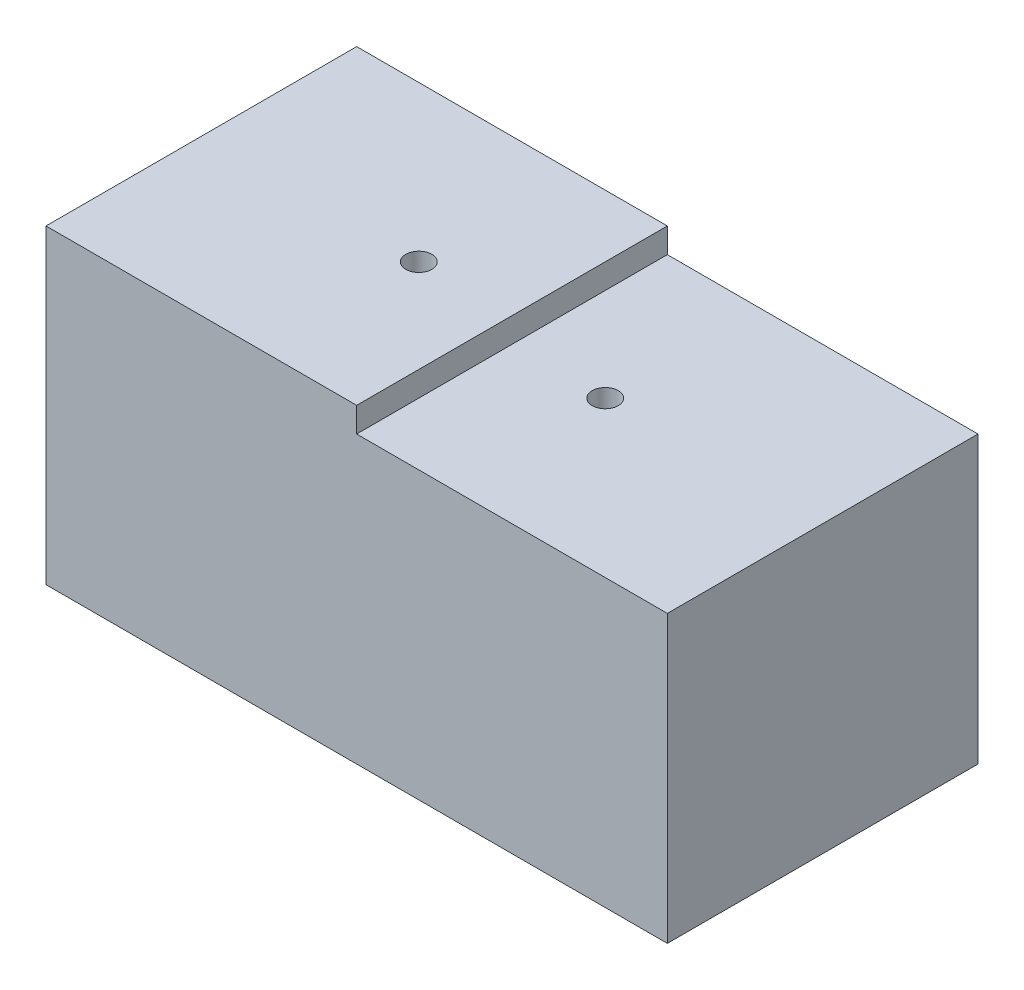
ISO-10303-21;
HEADER;
FILE_DESCRIPTION(('STEP AP214'),'2;1');
FILE_NAME('part.step','',(''),(''),'','','');
FILE_SCHEMA(('AUTOMOTIVE_DESIGN { 1 0 10303 214 1 1 1 1 }'));
ENDSEC;
DATA;
#1=APPLICATION_CONTEXT('core data for automotive mechanical design processes');
#2=APPLICATION_PROTOCOL_DEFINITION('international standard','automotive_design',2000,#1);
#3=PRODUCT_CONTEXT('',#1,'mechanical');
#4=PRODUCT('Part','Part','',(#3));
#5=PRODUCT_RELATED_PRODUCT_CATEGORY('part','',(#4));
#6=PRODUCT_DEFINITION_FORMATION('','',#4);
#7=PRODUCT_DEFINITION_CONTEXT('part definition',#1,'design');
#8=PRODUCT_DEFINITION('design','',#6,#7);
#9=PRODUCT_DEFINITION_SHAPE('','',#8);
#10=(LENGTH_UNIT() NAMED_UNIT(*) SI_UNIT(.MILLI.,.METRE.));
#11=(NAMED_UNIT(*) PLANE_ANGLE_UNIT() SI_UNIT($,.RADIAN.));
#12=(NAMED_UNIT(*) SI_UNIT($,.STERADIAN.) SOLID_ANGLE_UNIT());
#13=UNCERTAINTY_MEASURE_WITH_UNIT(LENGTH_MEASURE(1.E-05),#10,'distance_accuracy_value','');
#14=(GEOMETRIC_REPRESENTATION_CONTEXT(3) GLOBAL_UNCERTAINTY_ASSIGNED_CONTEXT((#13)) GLOBAL_UNIT_ASSIGNED_CONTEXT((#10,
#11,#12)) REPRESENTATION_CONTEXT('',''));
#15=CARTESIAN_POINT('',(0.,0.,0.));
#16=DIRECTION('',(0.,0.,1.));
#17=DIRECTION('',(1.,0.,0.));
#18=AXIS2_PLACEMENT_3D('',#15,#16,#17);
#19=CARTESIAN_POINT('',(50.,25.,25.));
#20=DIRECTION('',(-1.,0.,0.));
#21=DIRECTION('',(0.,-1.,0.));
#22=AXIS2_PLACEMENT_3D('',#19,#20,#21);
#23=PLANE('',#22);
#24=DIRECTION('',(0.,1.,0.));
#25=VECTOR('',#24,1.);
#26=CARTESIAN_POINT('',(50.,25.,-25.));
#27=LINE('',#26,#25);
#28=CARTESIAN_POINT('',(50.,-25.,-25.));
#29=VERTEX_POINT('',#28);
#30=CARTESIAN_POINT('',(50.,21.,-25.));
#31=VERTEX_POINT('',#30);
#32=EDGE_CURVE('E121',#29,#31,#27,.T.);
#33=ORIENTED_EDGE('',*,*,#32,.T.);
#34=DIRECTION('',(0.,0.,1.));
#35=VECTOR('',#34,1.);
#36=CARTESIAN_POINT('',(50.,21.,-25.001));
#37=LINE('',#36,#35);
#38=CARTESIAN_POINT('',(50.,21.,25.));
#39=VERTEX_POINT('',#38);
#40=EDGE_CURVE('E118',#31,#39,#37,.T.);
#41=ORIENTED_EDGE('',*,*,#40,.T.);
#42=DIRECTION('',(0.,1.,0.));
#43=VECTOR('',#42,1.);
#44=CARTESIAN_POINT('',(50.,25.,25.));
#45=LINE('',#44,#43);
#46=CARTESIAN_POINT('',(50.,-25.,25.));
#47=VERTEX_POINT('',#46);
#48=EDGE_CURVE('E132',#47,#39,#45,.T.);
#49=ORIENTED_EDGE('',*,*,#48,.F.);
#50=DIRECTION('',(0.,0.,-1.));
#51=VECTOR('',#50,1.);
#52=CARTESIAN_POINT('',(50.,-25.,25.));
#53=LINE('',#52,#51);
#54=EDGE_CURVE('E139',#47,#29,#53,.T.);
#55=ORIENTED_EDGE('',*,*,#54,.T.);
#56=EDGE_LOOP('',(#33,#41,#49,#55));
#57=FACE_BOUND('',#56,.T.);
#58=ADVANCED_FACE('F31',(#57),#23,.F.);
#59=CARTESIAN_POINT('',(50.,25.,25.));
#60=DIRECTION('',(0.,-1.,0.));
#61=DIRECTION('',(1.,0.,0.));
#62=AXIS2_PLACEMENT_3D('',#59,#60,#61);
#63=PLANE('',#62);
#64=CARTESIAN_POINT('',(-15.,25.,0.));
#65=DIRECTION('',(0.,1.,0.));
#66=DIRECTION('',(-1.,0.,0.));
#67=AXIS2_PLACEMENT_3D('',#64,#65,#66);
#68=CIRCLE('',#67,2.1);
#69=CARTESIAN_POINT('',(-17.1,25.,0.));
#70=VERTEX_POINT('',#69);
#71=EDGE_CURVE('E104',#70,#70,#68,.T.);
#72=ORIENTED_EDGE('',*,*,#71,.F.);
#73=EDGE_LOOP('',(#72));
#74=FACE_BOUND('',#73,.T.);
#75=DIRECTION('',(-1.,0.,0.));
#76=VECTOR('',#75,1.);
#77=CARTESIAN_POINT('',(50.,25.,25.));
#78=LINE('',#77,#76);
#79=CARTESIAN_POINT('',(0.,25.,25.));
#80=VERTEX_POINT('',#79);
#81=CARTESIAN_POINT('',(-50.,25.,25.));
#82=VERTEX_POINT('',#81);
#83=EDGE_CURVE('E134',#80,#82,#78,.T.);
#84=ORIENTED_EDGE('',*,*,#83,.F.);
#85=DIRECTION('',(0.,0.,1.));
#86=VECTOR('',#85,1.);
#87=CARTESIAN_POINT('',(0.,25.,-25.001));
#88=LINE('',#87,#86);
#89=CARTESIAN_POINT('',(0.,25.,-25.));
#90=VERTEX_POINT('',#89);
#91=EDGE_CURVE('E117',#90,#80,#88,.T.);
#92=ORIENTED_EDGE('',*,*,#91,.F.);
#93=DIRECTION('',(-1.,0.,0.));
#94=VECTOR('',#93,1.);
#95=CARTESIAN_POINT('',(50.,25.,-25.));
#96=LINE('',#95,#94);
#97=CARTESIAN_POINT('',(-50.,25.,-25.));
#98=VERTEX_POINT('',#97);
#99=EDGE_CURVE('E126',#90,#98,#96,.T.);
#100=ORIENTED_EDGE('',*,*,#99,.T.);
#101=DIRECTION('',(0.,0.,-1.));
#102=VECTOR('',#101,1.);
#103=CARTESIAN_POINT('',(-50.,25.,25.));
#104=LINE('',#103,#102);
#105=EDGE_CURVE('E11',#82,#98,#104,.T.);
#106=ORIENTED_EDGE('',*,*,#105,.F.);
#107=EDGE_LOOP('',(#84,#92,#100,#106));
#108=FACE_BOUND('',#107,.T.);
#109=ADVANCED_FACE('F165',(#74,#108),#63,.F.);
#110=CARTESIAN_POINT('',(-50.,25.,25.));
#111=DIRECTION('',(1.,0.,0.));
#112=DIRECTION('',(0.,1.,0.));
#113=AXIS2_PLACEMENT_3D('',#110,#111,#112);
#114=PLANE('',#113);
#115=DIRECTION('',(0.,-1.,0.));
#116=VECTOR('',#115,1.);
#117=CARTESIAN_POINT('',(-50.,25.,-25.));
#118=LINE('',#117,#116);
#119=CARTESIAN_POINT('',(-50.,-25.,-25.));
#120=VERTEX_POINT('',#119);
#121=EDGE_CURVE('E128',#98,#120,#118,.T.);
#122=ORIENTED_EDGE('',*,*,#121,.T.);
#123=DIRECTION('',(0.,0.,-1.));
#124=VECTOR('',#123,1.);
#125=CARTESIAN_POINT('',(-50.,-25.,25.));
#126=LINE('',#125,#124);
#127=CARTESIAN_POINT('',(-50.,-25.,25.));
#128=VERTEX_POINT('',#127);
#129=EDGE_CURVE('E39',#128,#120,#126,.T.);
#130=ORIENTED_EDGE('',*,*,#129,.F.);
#131=DIRECTION('',(0.,-1.,0.));
#132=VECTOR('',#131,1.);
#133=CARTESIAN_POINT('',(-50.,25.,25.));
#134=LINE('',#133,#132);
#135=EDGE_CURVE('E136',#82,#128,#134,.T.);
#136=ORIENTED_EDGE('',*,*,#135,.F.);
#137=ORIENTED_EDGE('',*,*,#105,.T.);
#138=EDGE_LOOP('',(#122,#130,#136,#137));
#139=FACE_BOUND('',#138,.T.);
#140=ADVANCED_FACE('F167',(#139),#114,.F.);
#141=CARTESIAN_POINT('',(50.,-25.,25.));
#142=DIRECTION('',(0.,1.,0.));
#143=DIRECTION('',(-1.,0.,0.));
#144=AXIS2_PLACEMENT_3D('',#141,#142,#143);
#145=PLANE('',#144);
#146=DIRECTION('',(1.,0.,0.));
#147=VECTOR('',#146,1.);
#148=CARTESIAN_POINT('',(50.,-25.,-25.));
#149=LINE('',#148,#147);
#150=EDGE_CURVE('E130',#120,#29,#149,.T.);
#151=ORIENTED_EDGE('',*,*,#150,.T.);
#152=ORIENTED_EDGE('',*,*,#54,.F.);
#153=DIRECTION('',(1.,0.,0.));
#154=VECTOR('',#153,1.);
#155=CARTESIAN_POINT('',(50.,-25.,25.));
#156=LINE('',#155,#154);
#157=EDGE_CURVE('E54',#128,#47,#156,.T.);
#158=ORIENTED_EDGE('',*,*,#157,.F.);
#159=ORIENTED_EDGE('',*,*,#129,.T.);
#160=EDGE_LOOP('',(#151,#152,#158,#159));
#161=FACE_BOUND('',#160,.T.);
#162=ADVANCED_FACE('F146',(#161),#145,.F.);
#163=CARTESIAN_POINT('',(50.,25.,25.));
#164=DIRECTION('',(0.,0.,-1.));
#165=DIRECTION('',(-1.,0.,0.));
#166=AXIS2_PLACEMENT_3D('',#163,#164,#165);
#167=PLANE('',#166);
#168=ORIENTED_EDGE('',*,*,#48,.T.);
#169=DIRECTION('',(1.,0.,0.));
#170=VECTOR('',#169,1.);
#171=CARTESIAN_POINT('',(50.,21.,25.));
#172=LINE('',#171,#170);
#173=CARTESIAN_POINT('',(0.,21.,25.));
#174=VERTEX_POINT('',#173);
#175=EDGE_CURVE('E115',#174,#39,#172,.T.);
#176=ORIENTED_EDGE('',*,*,#175,.F.);
#177=DIRECTION('',(0.,-1.,0.));
#178=VECTOR('',#177,1.);
#179=CARTESIAN_POINT('',(0.,25.,25.));
#180=LINE('',#179,#178);
#181=EDGE_CURVE('E113',#80,#174,#180,.T.);
#182=ORIENTED_EDGE('',*,*,#181,.F.);
#183=ORIENTED_EDGE('',*,*,#83,.T.);
#184=ORIENTED_EDGE('',*,*,#135,.T.);
#185=ORIENTED_EDGE('',*,*,#157,.T.);
#186=EDGE_LOOP('',(#168,#176,#182,#183,#184,#185));
#187=FACE_BOUND('',#186,.T.);
#188=ADVANCED_FACE('F157',(#187),#167,.F.);
#189=CARTESIAN_POINT('',(50.,25.,-25.));
#190=DIRECTION('',(0.,0.,-1.));
#191=DIRECTION('',(-1.,0.,0.));
#192=AXIS2_PLACEMENT_3D('',#189,#190,#191);
#193=PLANE('',#192);
#194=DIRECTION('',(1.,0.,0.));
#195=VECTOR('',#194,1.);
#196=CARTESIAN_POINT('',(50.,21.,-25.));
#197=LINE('',#196,#195);
#198=CARTESIAN_POINT('',(0.,21.,-25.));
#199=VERTEX_POINT('',#198);
#200=EDGE_CURVE('E110',#199,#31,#197,.T.);
#201=ORIENTED_EDGE('',*,*,#200,.T.);
#202=ORIENTED_EDGE('',*,*,#32,.F.);
#203=ORIENTED_EDGE('',*,*,#150,.F.);
#204=ORIENTED_EDGE('',*,*,#121,.F.);
#205=ORIENTED_EDGE('',*,*,#99,.F.);
#206=DIRECTION('',(0.,-1.,0.));
#207=VECTOR('',#206,1.);
#208=CARTESIAN_POINT('',(0.,25.,-25.));
#209=LINE('',#208,#207);
#210=EDGE_CURVE('E107',#90,#199,#209,.T.);
#211=ORIENTED_EDGE('',*,*,#210,.T.);
#212=EDGE_LOOP('',(#201,#202,#203,#204,#205,#211));
#213=FACE_BOUND('',#212,.T.);
#214=ADVANCED_FACE('F152',(#213),#193,.T.);
#215=CARTESIAN_POINT('',(50.,21.,-25.001));
#216=DIRECTION('',(0.,-1.,0.));
#217=DIRECTION('',(1.,0.,0.));
#218=AXIS2_PLACEMENT_3D('',#215,#216,#217);
#219=PLANE('',#218);
#220=CARTESIAN_POINT('',(15.,21.,0.));
#221=DIRECTION('',(0.,-1.,0.));
#222=DIRECTION('',(1.,0.,0.));
#223=AXIS2_PLACEMENT_3D('',#220,#221,#222);
#224=CIRCLE('',#223,2.1);
#225=CARTESIAN_POINT('',(17.1,21.,0.));
#226=VERTEX_POINT('',#225);
#227=EDGE_CURVE('E34',#226,#226,#224,.T.);
#228=ORIENTED_EDGE('',*,*,#227,.T.);
#229=EDGE_LOOP('',(#228));
#230=FACE_BOUND('',#229,.T.);
#231=DIRECTION('',(0.,0.,1.));
#232=VECTOR('',#231,1.);
#233=CARTESIAN_POINT('',(0.,21.,-25.001));
#234=LINE('',#233,#232);
#235=EDGE_CURVE('E46',#199,#174,#234,.T.);
#236=ORIENTED_EDGE('',*,*,#235,.T.);
#237=ORIENTED_EDGE('',*,*,#175,.T.);
#238=ORIENTED_EDGE('',*,*,#40,.F.);
#239=ORIENTED_EDGE('',*,*,#200,.F.);
#240=EDGE_LOOP('',(#236,#237,#238,#239));
#241=FACE_BOUND('',#240,.T.);
#242=ADVANCED_FACE('F161',(#230,#241),#219,.F.);
#243=CARTESIAN_POINT('',(0.,25.,-25.001));
#244=DIRECTION('',(-1.,0.,0.));
#245=DIRECTION('',(0.,0.,1.));
#246=AXIS2_PLACEMENT_3D('',#243,#244,#245);
#247=PLANE('',#246);
#248=ORIENTED_EDGE('',*,*,#91,.T.);
#249=ORIENTED_EDGE('',*,*,#181,.T.);
#250=ORIENTED_EDGE('',*,*,#235,.F.);
#251=ORIENTED_EDGE('',*,*,#210,.F.);
#252=EDGE_LOOP('',(#248,#249,#250,#251));
#253=FACE_BOUND('',#252,.T.);
#254=ADVANCED_FACE('F162',(#253),#247,.F.);
#255=CARTESIAN_POINT('',(-15.,5.,0.));
#256=DIRECTION('',(0.,1.,0.));
#257=DIRECTION('',(-1.,0.,0.));
#258=AXIS2_PLACEMENT_3D('',#255,#256,#257);
#259=CYLINDRICAL_SURFACE('',#258,2.1);
#260=CARTESIAN_POINT('',(-15.,5.,0.));
#261=DIRECTION('',(0.,1.,0.));
#262=DIRECTION('',(-1.,0.,0.));
#263=AXIS2_PLACEMENT_3D('',#260,#261,#262);
#264=CIRCLE('',#263,2.1);
#265=CARTESIAN_POINT('',(-17.1,5.,0.));
#266=VERTEX_POINT('',#265);
#267=EDGE_CURVE('E100',#266,#266,#264,.T.);
#268=ORIENTED_EDGE('',*,*,#267,.F.);
#269=EDGE_LOOP('',(#268));
#270=FACE_BOUND('',#269,.T.);
#271=ORIENTED_EDGE('',*,*,#71,.T.);
#272=EDGE_LOOP('',(#271));
#273=FACE_BOUND('',#272,.T.);
#274=ADVANCED_FACE('F200',(#270,#273),#259,.F.);
#275=CARTESIAN_POINT('',(-15.,5.,0.));
#276=DIRECTION('',(0.,1.,0.));
#277=DIRECTION('',(-1.,0.,0.));
#278=AXIS2_PLACEMENT_3D('',#275,#276,#277);
#279=CONICAL_SURFACE('',#278,2.1,1.02974425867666);
#280=CARTESIAN_POINT('',(-15.,3.73819270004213,0.));
#281=VERTEX_POINT('',#280);
#282=VERTEX_LOOP('',#281);
#283=FACE_BOUND('',#282,.T.);
#284=ORIENTED_EDGE('',*,*,#267,.T.);
#285=EDGE_LOOP('',(#284));
#286=FACE_BOUND('',#285,.T.);
#287=ADVANCED_FACE('F212',(#283,#286),#279,.F.);
#288=CARTESIAN_POINT('',(15.,5.00000000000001,0.));
#289=DIRECTION('',(0.,1.,0.));
#290=DIRECTION('',(-1.,0.,0.));
#291=AXIS2_PLACEMENT_3D('',#288,#289,#290);
#292=CYLINDRICAL_SURFACE('',#291,2.1);
#293=CARTESIAN_POINT('',(15.,5.00000000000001,0.));
#294=DIRECTION('',(0.,1.,0.));
#295=DIRECTION('',(-1.,0.,0.));
#296=AXIS2_PLACEMENT_3D('',#293,#294,#295);
#297=CIRCLE('',#296,2.1);
#298=CARTESIAN_POINT('',(12.9,5.00000000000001,0.));
#299=VERTEX_POINT('',#298);
#300=EDGE_CURVE('E96',#299,#299,#297,.T.);
#301=ORIENTED_EDGE('',*,*,#300,.F.);
#302=EDGE_LOOP('',(#301));
#303=FACE_BOUND('',#302,.T.);
#304=ORIENTED_EDGE('',*,*,#227,.F.);
#305=EDGE_LOOP('',(#304));
#306=FACE_BOUND('',#305,.T.);
#307=ADVANCED_FACE('F92',(#303,#306),#292,.F.);
#308=CARTESIAN_POINT('',(15.,5.00000000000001,0.));
#309=DIRECTION('',(0.,1.,0.));
#310=DIRECTION('',(-1.,0.,0.));
#311=AXIS2_PLACEMENT_3D('',#308,#309,#310);
#312=CONICAL_SURFACE('',#311,2.1,1.02974425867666);
#313=CARTESIAN_POINT('',(15.,3.73819270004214,0.));
#314=VERTEX_POINT('',#313);
#315=VERTEX_LOOP('',#314);
#316=FACE_BOUND('',#315,.T.);
#317=ORIENTED_EDGE('',*,*,#300,.T.);
#318=EDGE_LOOP('',(#317));
#319=FACE_BOUND('',#318,.T.);
#320=ADVANCED_FACE('F89',(#316,#319),#312,.F.);
#321=CLOSED_SHELL('',(#58,#109,#140,#162,#188,#214,#242,#254,#274,#287,#307,#320));
#322=MANIFOLD_SOLID_BREP('B2',#321);
#323=ADVANCED_BREP_SHAPE_REPRESENTATION('',(#18,#322),#14);
#324=SHAPE_DEFINITION_REPRESENTATION(#9,#323);
ENDSEC;
END-ISO-10303-21;
